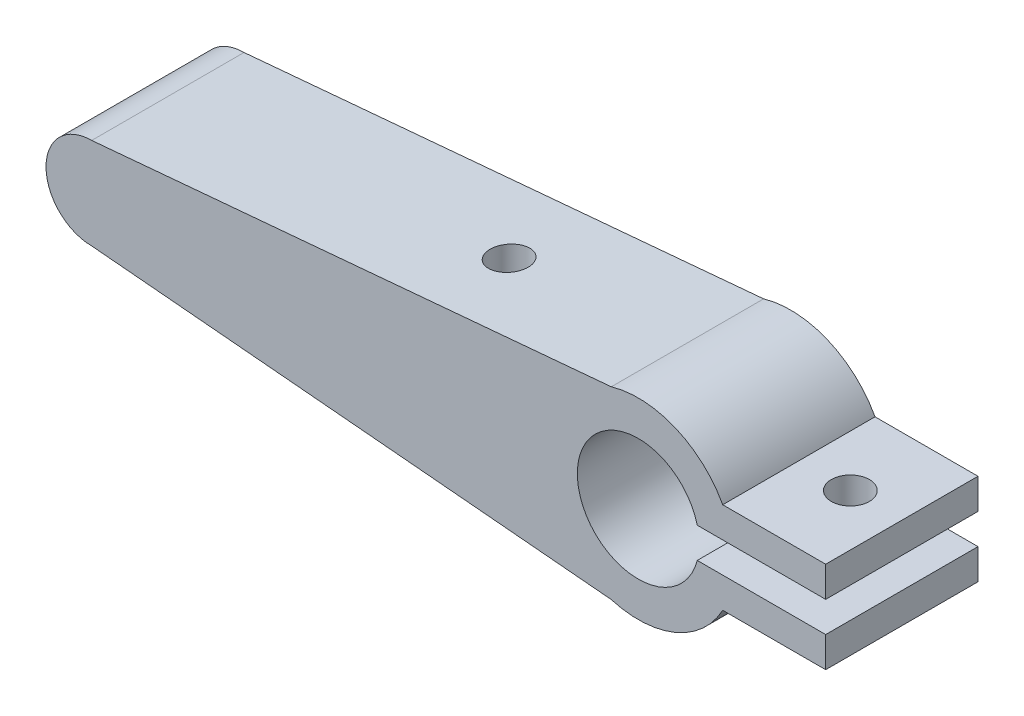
from build123d import *

# Parameters (mm, degrees)
BOSS_EXTRUDE2_DEPTH     = 10
SKETCH2_R               = 1.25
CUT_EXTRUDE2_DEPTH      = 10
CUT_EXTRUDE3_DEPTH      = 20
CUT_EXTRUDE3_DEPTH_BACK = 20
SKETCH4_R               = 1.25


with BuildPart() as part:
    # Sketch1 → Boss-Extrude2 (new body)
    with BuildSketch(Plane.XY):
        with BuildLine():
            Line((-58.652650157, -257.782156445), (-24.540924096, -260.832486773))
            ThreePointArc((-24.540924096, -260.832486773), (-20.344140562, -260.600604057), (-17.225949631, -257.782156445))
            Line((-17.225949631, -257.782156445), (-16.466361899, -257.782156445))
            Line((-16.466361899, -257.782156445), (-10.466361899, -257.782156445))
            Line((-10.466361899, -257.782156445), (-10.466361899, -255.782156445))
            Line((-10.466361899, -255.782156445), (-18.897438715, -255.782156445))
            ThreePointArc((-18.897438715, -255.782156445), (-26.770422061, -254.782156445), (-18.897438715, -253.782156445))
            Line((-18.897438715, -253.782156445), (-10.466361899, -253.782156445))
            Line((-10.466361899, -253.782156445), (-10.466361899, -251.782156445))
            Line((-10.466361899, -251.782156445), (-16.466361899, -251.782156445))
            Line((-16.466361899, -251.782156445), (-17.225949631, -251.782156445))
            ThreePointArc((-17.225949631, -251.782156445), (-20.344140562, -248.963708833), (-24.540924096, -248.731826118))
            Line((-24.540924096, -248.731826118), (-58.652650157, -251.782156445))
            ThreePointArc((-58.652650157, -251.782156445), (-61.652650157, -254.782156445), (-58.652650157, -257.782156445))
        make_face()
    extrude(amount=BOSS_EXTRUDE2_DEPTH)

    # Sketch2 → Cut-Extrude2 (cut)
    with BuildSketch(Plane.XZ.offset(257.782156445)):
        with Locations(Location((-13.846155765, 5, 0), (0, 0, 270))):
            Circle(SKETCH2_R)
    extrude(amount=-CUT_EXTRUDE2_DEPTH, mode=Mode.SUBTRACT)

    # Sketch4 → Cut-Extrude3 (cut, two sides: drawn at the far end of the back side and taken through both)
    with BuildSketch(Plane.XZ.offset(257.782156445).offset(-CUT_EXTRUDE3_DEPTH_BACK)):
        with Locations((-36.249402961, 5)):
            Circle(SKETCH4_R)
    extrude(amount=CUT_EXTRUDE3_DEPTH + CUT_EXTRUDE3_DEPTH_BACK, mode=Mode.SUBTRACT)


solid = part.part
